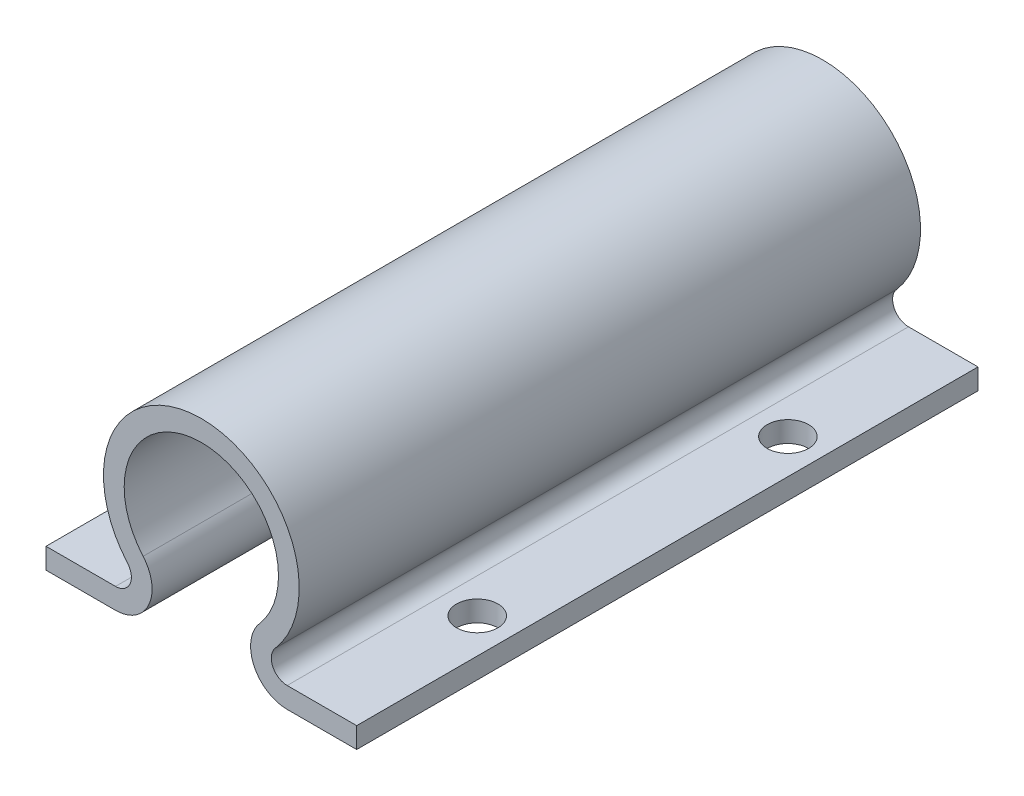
from build123d import *

# Parameters (mm, degrees)
BOSS_EXTRUDE1_DEPTH = 76.2
SKETCH2_R           = 2.54
CUT_EXTRUDE1_DEPTH  = 5.08


with BuildPart() as part:
    # Sketch1 → Boss-Extrude1 (new body)
    with BuildSketch(Plane.XY):
        with BuildLine():
            Line((10.002406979, 0), (18.527613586, 0))
            Line((18.527613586, 0), (18.527613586, 2.54))
            Line((18.527613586, 2.54), (10.002406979, 2.54))
            ThreePointArc((10.002406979, 2.54), (8.232095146, 3.678777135), (8.534325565, 5.761917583))
            ThreePointArc((8.534325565, 5.761917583), (-0.522386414, 25.638185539), (-9.579098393, 5.761917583))
            ThreePointArc((-9.579098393, 5.761917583), (-9.276867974, 3.678777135), (-11.047179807, 2.54))
            Line((-11.047179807, 2.54), (-19.572386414, 2.54))
            Line((-19.572386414, 2.54), (-19.572386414, 0))
            Line((-19.572386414, 0), (-11.047179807, 0))
            ThreePointArc((-11.047179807, 0), (-6.96550381, 2.625593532), (-7.662333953, 7.42853514))
            ThreePointArc((-7.662333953, 7.42853514), (-0.522386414, 23.098185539), (6.617561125, 7.42853514))
            ThreePointArc((6.617561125, 7.42853514), (5.920730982, 2.625593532), (10.002406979, 0))
        make_face()
    extrude(amount=BOSS_EXTRUDE1_DEPTH)

    # Sketch2 → Cut-Extrude1 (cut)
    with BuildSketch(Plane(origin=(0, 2.54, 0), x_dir=(1, 0, 0), z_dir=(0, 1, 0))):
        with Locations(Location((14.265010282, -19.05, 0), (0, 0, 270))):
            Circle(SKETCH2_R)
        with Locations(Location((14.265010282, -57.15, 0), (0, 0, 270))):
            Circle(SKETCH2_R)
        with Locations(Location((-15.309783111, -57.15, 0), (0, 0, 180))):
            Circle(SKETCH2_R)
        with Locations(Location((-15.309783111, -19.05, 0), (0, 0, 180))):
            Circle(SKETCH2_R)
    extrude(amount=-CUT_EXTRUDE1_DEPTH, mode=Mode.SUBTRACT)


solid = part.part
